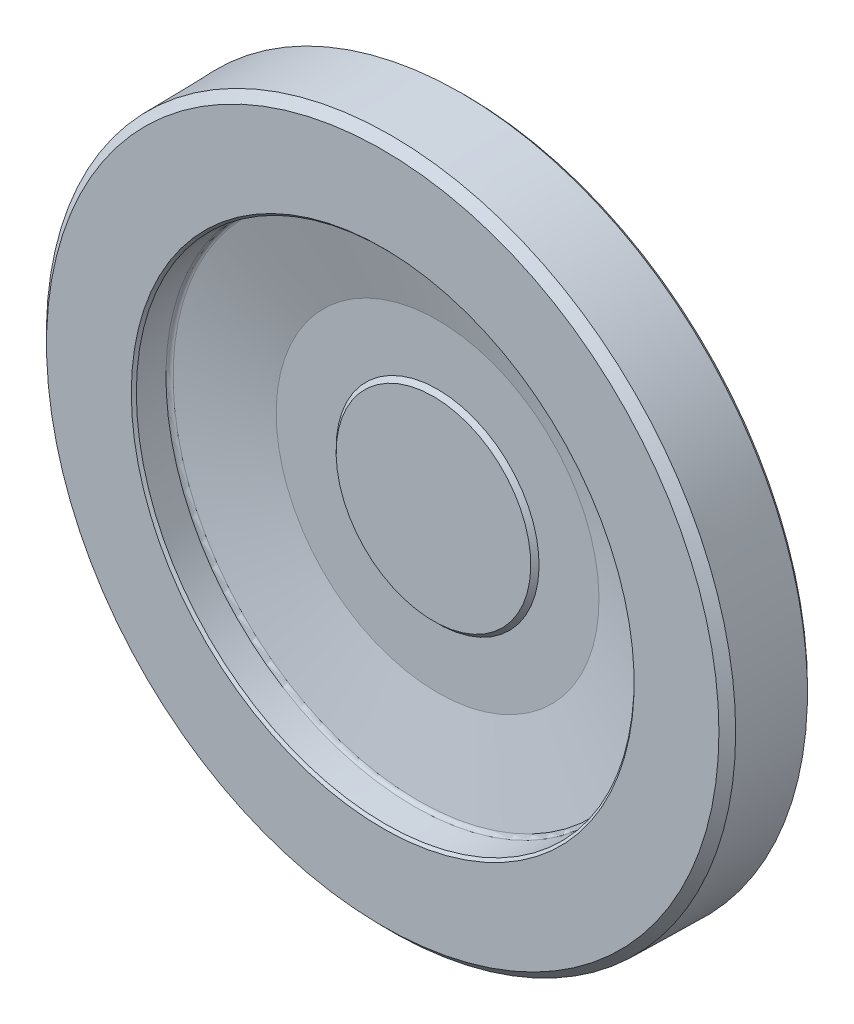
ISO-10303-21;
HEADER;
FILE_DESCRIPTION(('STEP AP214'),'2;1');
FILE_NAME('part.step','',(''),(''),'','','');
FILE_SCHEMA(('AUTOMOTIVE_DESIGN { 1 0 10303 214 1 1 1 1 }'));
ENDSEC;
DATA;
#1=APPLICATION_CONTEXT('core data for automotive mechanical design processes');
#2=APPLICATION_PROTOCOL_DEFINITION('international standard','automotive_design',2000,#1);
#3=PRODUCT_CONTEXT('',#1,'mechanical');
#4=PRODUCT('Part','Part','',(#3));
#5=PRODUCT_RELATED_PRODUCT_CATEGORY('part','',(#4));
#6=PRODUCT_DEFINITION_FORMATION('','',#4);
#7=PRODUCT_DEFINITION_CONTEXT('part definition',#1,'design');
#8=PRODUCT_DEFINITION('design','',#6,#7);
#9=PRODUCT_DEFINITION_SHAPE('','',#8);
#10=(LENGTH_UNIT() NAMED_UNIT(*) SI_UNIT(.MILLI.,.METRE.));
#11=(NAMED_UNIT(*) PLANE_ANGLE_UNIT() SI_UNIT($,.RADIAN.));
#12=(NAMED_UNIT(*) SI_UNIT($,.STERADIAN.) SOLID_ANGLE_UNIT());
#13=UNCERTAINTY_MEASURE_WITH_UNIT(LENGTH_MEASURE(1.E-05),#10,'distance_accuracy_value','');
#14=(GEOMETRIC_REPRESENTATION_CONTEXT(3) GLOBAL_UNCERTAINTY_ASSIGNED_CONTEXT((#13)) GLOBAL_UNIT_ASSIGNED_CONTEXT((#10,
#11,#12)) REPRESENTATION_CONTEXT('',''));
#15=CARTESIAN_POINT('',(0.,0.,0.));
#16=DIRECTION('',(0.,0.,1.));
#17=DIRECTION('',(1.,0.,0.));
#18=AXIS2_PLACEMENT_3D('',#15,#16,#17);
#19=CARTESIAN_POINT('',(0.,0.,38.));
#20=DIRECTION('',(0.,0.,-1.));
#21=DIRECTION('',(0.,1.,0.));
#22=AXIS2_PLACEMENT_3D('',#19,#20,#21);
#23=PLANE('',#22);
#24=CARTESIAN_POINT('',(0.,0.,38.));
#25=DIRECTION('',(0.,0.,-1.));
#26=DIRECTION('',(0.,1.,0.));
#27=AXIS2_PLACEMENT_3D('',#24,#25,#26);
#28=CIRCLE('',#27,21.1);
#29=CARTESIAN_POINT('',(0.,21.1,38.));
#30=VERTEX_POINT('',#29);
#31=EDGE_CURVE('E15',#30,#30,#28,.T.);
#32=ORIENTED_EDGE('',*,*,#31,.F.);
#33=EDGE_LOOP('',(#32));
#34=FACE_BOUND('',#33,.T.);
#35=ADVANCED_FACE('F12',(#34),#23,.F.);
#36=CARTESIAN_POINT('',(0.,0.,37.1));
#37=DIRECTION('',(0.,0.,-1.));
#38=DIRECTION('',(0.,1.,0.));
#39=AXIS2_PLACEMENT_3D('',#36,#37,#38);
#40=CONICAL_SURFACE('',#39,22.,0.785398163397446);
#41=ORIENTED_EDGE('',*,*,#31,.T.);
#42=EDGE_LOOP('',(#41));
#43=FACE_BOUND('',#42,.T.);
#44=CARTESIAN_POINT('',(0.,0.,37.1));
#45=DIRECTION('',(0.,0.,-1.));
#46=DIRECTION('',(0.,1.,0.));
#47=AXIS2_PLACEMENT_3D('',#44,#45,#46);
#48=CIRCLE('',#47,22.);
#49=CARTESIAN_POINT('',(0.,22.,37.1));
#50=VERTEX_POINT('',#49);
#51=EDGE_CURVE('E54',#50,#50,#48,.F.);
#52=ORIENTED_EDGE('',*,*,#51,.T.);
#53=EDGE_LOOP('',(#52));
#54=FACE_BOUND('',#53,.T.);
#55=ADVANCED_FACE('F61',(#43,#54),#40,.T.);
#56=CARTESIAN_POINT('',(15.25,0.,0.));
#57=DIRECTION('',(0.,0.,1.));
#58=DIRECTION('',(0.,-1.,0.));
#59=AXIS2_PLACEMENT_3D('',#56,#57,#58);
#60=PLANE('',#59);
#61=CARTESIAN_POINT('',(0.,0.,0.));
#62=DIRECTION('',(0.,0.,1.));
#63=DIRECTION('',(-1.,0.,0.));
#64=AXIS2_PLACEMENT_3D('',#61,#62,#63);
#65=CIRCLE('',#64,15.25);
#66=CARTESIAN_POINT('',(-15.25,0.,0.));
#67=VERTEX_POINT('',#66);
#68=EDGE_CURVE('E52',#67,#67,#65,.T.);
#69=ORIENTED_EDGE('',*,*,#68,.F.);
#70=EDGE_LOOP('',(#69));
#71=FACE_BOUND('',#70,.T.);
#72=ADVANCED_FACE('F68',(#71),#60,.F.);
#73=CARTESIAN_POINT('',(22.,0.,37.1));
#74=DIRECTION('',(0.,0.,-1.));
#75=DIRECTION('',(0.,1.,0.));
#76=AXIS2_PLACEMENT_3D('',#73,#74,#75);
#77=PLANE('',#76);
#78=ORIENTED_EDGE('',*,*,#51,.F.);
#79=EDGE_LOOP('',(#78));
#80=FACE_BOUND('',#79,.T.);
#81=CARTESIAN_POINT('',(0.,0.,37.1));
#82=DIRECTION('',(0.,0.,1.));
#83=DIRECTION('',(0.,-1.,0.));
#84=AXIS2_PLACEMENT_3D('',#81,#82,#83);
#85=CIRCLE('',#84,35.);
#86=CARTESIAN_POINT('',(0.,-35.,37.1));
#87=VERTEX_POINT('',#86);
#88=EDGE_CURVE('E48',#87,#87,#85,.T.);
#89=ORIENTED_EDGE('',*,*,#88,.T.);
#90=EDGE_LOOP('',(#89));
#91=FACE_BOUND('',#90,.T.);
#92=ADVANCED_FACE('F159',(#80,#91),#77,.F.);
#93=CARTESIAN_POINT('',(0.,0.,0.75));
#94=DIRECTION('',(0.,0.,1.));
#95=DIRECTION('',(-1.,0.,0.));
#96=AXIS2_PLACEMENT_3D('',#93,#94,#95);
#97=CONICAL_SURFACE('',#96,16.,0.785398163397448);
#98=CARTESIAN_POINT('',(0.,0.,0.75));
#99=DIRECTION('',(0.,0.,1.));
#100=DIRECTION('',(0.,-1.,0.));
#101=AXIS2_PLACEMENT_3D('',#98,#99,#100);
#102=CIRCLE('',#101,16.);
#103=CARTESIAN_POINT('',(0.,-16.,0.75));
#104=VERTEX_POINT('',#103);
#105=EDGE_CURVE('E51',#104,#104,#102,.T.);
#106=ORIENTED_EDGE('',*,*,#105,.F.);
#107=EDGE_LOOP('',(#106));
#108=FACE_BOUND('',#107,.T.);
#109=ORIENTED_EDGE('',*,*,#68,.T.);
#110=EDGE_LOOP('',(#109));
#111=FACE_BOUND('',#110,.T.);
#112=ADVANCED_FACE('F155',(#108,#111),#97,.T.);
#113=CARTESIAN_POINT('',(0.,0.,41.2928015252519));
#114=DIRECTION('',(0.,0.,1.));
#115=DIRECTION('',(0.,-1.,0.));
#116=AXIS2_PLACEMENT_3D('',#113,#114,#115);
#117=CONICAL_SURFACE('',#116,53.1610186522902,1.34390352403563);
#118=ORIENTED_EDGE('',*,*,#88,.F.);
#119=EDGE_LOOP('',(#118));
#120=FACE_BOUND('',#119,.T.);
#121=CARTESIAN_POINT('',(0.,0.,41.2928015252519));
#122=DIRECTION('',(0.,0.,-1.));
#123=DIRECTION('',(0.,1.,0.));
#124=AXIS2_PLACEMENT_3D('',#121,#122,#123);
#125=CIRCLE('',#124,53.1610186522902);
#126=CARTESIAN_POINT('',(0.,53.1610186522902,41.2928015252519));
#127=VERTEX_POINT('',#126);
#128=EDGE_CURVE('E47',#127,#127,#125,.F.);
#129=ORIENTED_EDGE('',*,*,#128,.T.);
#130=EDGE_LOOP('',(#129));
#131=FACE_BOUND('',#130,.T.);
#132=ADVANCED_FACE('F158',(#120,#131),#117,.F.);
#133=CARTESIAN_POINT('',(0.,0.,0.));
#134=DIRECTION('',(0.,0.,1.));
#135=DIRECTION('',(0.,-1.,0.));
#136=AXIS2_PLACEMENT_3D('',#133,#134,#135);
#137=CYLINDRICAL_SURFACE('',#136,16.);
#138=CARTESIAN_POINT('',(0.,0.,15.));
#139=DIRECTION('',(0.,0.,1.));
#140=DIRECTION('',(0.,-1.,0.));
#141=AXIS2_PLACEMENT_3D('',#138,#139,#140);
#142=CIRCLE('',#141,16.);
#143=CARTESIAN_POINT('',(0.,-16.,15.));
#144=VERTEX_POINT('',#143);
#145=EDGE_CURVE('E44',#144,#144,#142,.F.);
#146=ORIENTED_EDGE('',*,*,#145,.T.);
#147=EDGE_LOOP('',(#146));
#148=FACE_BOUND('',#147,.T.);
#149=ORIENTED_EDGE('',*,*,#105,.T.);
#150=EDGE_LOOP('',(#149));
#151=FACE_BOUND('',#150,.T.);
#152=ADVANCED_FACE('F140',(#148,#151),#137,.T.);
#153=CARTESIAN_POINT('',(0.,0.,42.1697345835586));
#154=DIRECTION('',(0.,0.,-1.));
#155=DIRECTION('',(0.,1.,0.));
#156=AXIS2_PLACEMENT_3D('',#153,#154,#155);
#157=TOROIDAL_SURFACE('',#156,52.9585627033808,0.9);
#158=ORIENTED_EDGE('',*,*,#128,.F.);
#159=EDGE_LOOP('',(#158));
#160=FACE_BOUND('',#159,.T.);
#161=CARTESIAN_POINT('',(0.,0.,42.154027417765));
#162=DIRECTION('',(0.,0.,1.));
#163=DIRECTION('',(0.,-1.,0.));
#164=AXIS2_PLACEMENT_3D('',#161,#162,#163);
#165=CIRCLE('',#164,53.8584256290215);
#166=CARTESIAN_POINT('',(0.,-53.8584256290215,42.1540274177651));
#167=VERTEX_POINT('',#166);
#168=EDGE_CURVE('E43',#167,#167,#165,.T.);
#169=ORIENTED_EDGE('',*,*,#168,.T.);
#170=EDGE_LOOP('',(#169));
#171=FACE_BOUND('',#170,.T.);
#172=ADVANCED_FACE('F135',(#160,#171),#157,.F.);
#173=CARTESIAN_POINT('',(24.,0.,15.));
#174=DIRECTION('',(0.,0.,1.));
#175=DIRECTION('',(0.,-1.,0.));
#176=AXIS2_PLACEMENT_3D('',#173,#174,#175);
#177=PLANE('',#176);
#178=CARTESIAN_POINT('',(0.,0.,15.));
#179=DIRECTION('',(0.,0.,1.));
#180=DIRECTION('',(0.,-1.,0.));
#181=AXIS2_PLACEMENT_3D('',#178,#179,#180);
#182=CIRCLE('',#181,24.);
#183=CARTESIAN_POINT('',(0.,-24.,15.));
#184=VERTEX_POINT('',#183);
#185=EDGE_CURVE('E39',#184,#184,#182,.T.);
#186=ORIENTED_EDGE('',*,*,#185,.F.);
#187=EDGE_LOOP('',(#186));
#188=FACE_BOUND('',#187,.T.);
#189=ORIENTED_EDGE('',*,*,#145,.F.);
#190=EDGE_LOOP('',(#189));
#191=FACE_BOUND('',#190,.T.);
#192=ADVANCED_FACE('F131',(#188,#191),#177,.F.);
#193=CARTESIAN_POINT('',(0.,0.,48.4600822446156));
#194=DIRECTION('',(0.,0.,1.));
#195=DIRECTION('',(0.,-1.,0.));
#196=AXIS2_PLACEMENT_3D('',#193,#194,#195);
#197=CONICAL_SURFACE('',#196,53.9684982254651,0.0174532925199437);
#198=ORIENTED_EDGE('',*,*,#168,.F.);
#199=EDGE_LOOP('',(#198));
#200=FACE_BOUND('',#199,.T.);
#201=CARTESIAN_POINT('',(0.,0.,48.4600822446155));
#202=DIRECTION('',(0.,0.,1.));
#203=DIRECTION('',(0.,-1.,0.));
#204=AXIS2_PLACEMENT_3D('',#201,#202,#203);
#205=CIRCLE('',#204,53.9684982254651);
#206=CARTESIAN_POINT('',(0.,-53.9684982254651,48.4600822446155));
#207=VERTEX_POINT('',#206);
#208=EDGE_CURVE('E42',#207,#207,#205,.T.);
#209=ORIENTED_EDGE('',*,*,#208,.T.);
#210=EDGE_LOOP('',(#209));
#211=FACE_BOUND('',#210,.T.);
#212=ADVANCED_FACE('F127',(#200,#211),#197,.F.);
#213=CARTESIAN_POINT('',(0.,0.,0.));
#214=DIRECTION('',(0.,0.,1.));
#215=DIRECTION('',(0.,-1.,0.));
#216=AXIS2_PLACEMENT_3D('',#213,#214,#215);
#217=CYLINDRICAL_SURFACE('',#216,24.);
#218=CARTESIAN_POINT('',(0.,0.,22.3765148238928));
#219=DIRECTION('',(0.,0.,-1.));
#220=DIRECTION('',(0.,1.,0.));
#221=AXIS2_PLACEMENT_3D('',#218,#219,#220);
#222=CIRCLE('',#221,24.);
#223=CARTESIAN_POINT('',(0.,24.,22.3765148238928));
#224=VERTEX_POINT('',#223);
#225=EDGE_CURVE('E38',#224,#224,#222,.T.);
#226=ORIENTED_EDGE('',*,*,#225,.T.);
#227=EDGE_LOOP('',(#226));
#228=FACE_BOUND('',#227,.T.);
#229=ORIENTED_EDGE('',*,*,#185,.T.);
#230=EDGE_LOOP('',(#229));
#231=FACE_BOUND('',#230,.T.);
#232=ADVANCED_FACE('F123',(#228,#231),#217,.T.);
#233=CARTESIAN_POINT('',(0.,0.,49.));
#234=DIRECTION('',(0.,0.,1.));
#235=DIRECTION('',(-1.,0.,0.));
#236=AXIS2_PLACEMENT_3D('',#233,#234,#235);
#237=CONICAL_SURFACE('',#236,54.5179225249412,0.794124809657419);
#238=ORIENTED_EDGE('',*,*,#208,.F.);
#239=EDGE_LOOP('',(#238));
#240=FACE_BOUND('',#239,.T.);
#241=CARTESIAN_POINT('',(0.,0.,49.));
#242=DIRECTION('',(0.,0.,1.));
#243=DIRECTION('',(-1.,0.,0.));
#244=AXIS2_PLACEMENT_3D('',#241,#242,#243);
#245=CIRCLE('',#244,54.5179225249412);
#246=CARTESIAN_POINT('',(-54.5179225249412,0.,49.));
#247=VERTEX_POINT('',#246);
#248=EDGE_CURVE('E35',#247,#247,#245,.T.);
#249=ORIENTED_EDGE('',*,*,#248,.T.);
#250=EDGE_LOOP('',(#249));
#251=FACE_BOUND('',#250,.T.);
#252=ADVANCED_FACE('F119',(#240,#251),#237,.F.);
#253=CARTESIAN_POINT('',(0.,0.,22.3765148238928));
#254=DIRECTION('',(0.,0.,-1.));
#255=DIRECTION('',(0.,1.,0.));
#256=AXIS2_PLACEMENT_3D('',#253,#254,#255);
#257=TOROIDAL_SURFACE('',#256,25.8,1.8);
#258=CARTESIAN_POINT('',(0.,0.,24.0679615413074));
#259=DIRECTION('',(0.,0.,1.));
#260=DIRECTION('',(0.,-1.,0.));
#261=AXIS2_PLACEMENT_3D('',#258,#259,#260);
#262=CIRCLE('',#261,25.1843637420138);
#263=CARTESIAN_POINT('',(0.,-25.1843637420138,24.0679615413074));
#264=VERTEX_POINT('',#263);
#265=EDGE_CURVE('E34',#264,#264,#262,.T.);
#266=ORIENTED_EDGE('',*,*,#265,.F.);
#267=EDGE_LOOP('',(#266));
#268=FACE_BOUND('',#267,.T.);
#269=ORIENTED_EDGE('',*,*,#225,.F.);
#270=EDGE_LOOP('',(#269));
#271=FACE_BOUND('',#270,.T.);
#272=ADVANCED_FACE('F114',(#268,#271),#257,.F.);
#273=CARTESIAN_POINT('',(54.5179225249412,0.,49.));
#274=DIRECTION('',(0.,0.,-1.));
#275=DIRECTION('',(0.,1.,0.));
#276=AXIS2_PLACEMENT_3D('',#273,#274,#275);
#277=PLANE('',#276);
#278=ORIENTED_EDGE('',*,*,#248,.F.);
#279=EDGE_LOOP('',(#278));
#280=FACE_BOUND('',#279,.T.);
#281=CARTESIAN_POINT('',(0.,0.,49.));
#282=DIRECTION('',(0.,0.,-1.));
#283=DIRECTION('',(1.,0.,0.));
#284=AXIS2_PLACEMENT_3D('',#281,#282,#283);
#285=CIRCLE('',#284,72.9015183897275);
#286=CARTESIAN_POINT('',(72.9015183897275,0.,49.));
#287=VERTEX_POINT('',#286);
#288=EDGE_CURVE('E30',#287,#287,#285,.T.);
#289=ORIENTED_EDGE('',*,*,#288,.F.);
#290=EDGE_LOOP('',(#289));
#291=FACE_BOUND('',#290,.T.);
#292=ADVANCED_FACE('F118',(#280,#291),#277,.F.);
#293=CARTESIAN_POINT('',(0.,0.,34.0603901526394));
#294=DIRECTION('',(0.,0.,1.));
#295=DIRECTION('',(0.,-1.,0.));
#296=AXIS2_PLACEMENT_3D('',#293,#294,#295);
#297=CONICAL_SURFACE('',#296,52.6383357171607,1.22173047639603);
#298=CARTESIAN_POINT('',(0.,0.,34.0603901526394));
#299=DIRECTION('',(0.,0.,-1.));
#300=DIRECTION('',(0.,1.,0.));
#301=AXIS2_PLACEMENT_3D('',#298,#299,#300);
#302=CIRCLE('',#301,52.6383357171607);
#303=CARTESIAN_POINT('',(0.,52.6383357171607,34.0603901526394));
#304=VERTEX_POINT('',#303);
#305=EDGE_CURVE('E33',#304,#304,#302,.T.);
#306=ORIENTED_EDGE('',*,*,#305,.T.);
#307=EDGE_LOOP('',(#306));
#308=FACE_BOUND('',#307,.T.);
#309=ORIENTED_EDGE('',*,*,#265,.T.);
#310=EDGE_LOOP('',(#309));
#311=FACE_BOUND('',#310,.T.);
#312=ADVANCED_FACE('F201',(#308,#311),#297,.T.);
#313=CARTESIAN_POINT('',(0.,0.,47.2002741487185));
#314=DIRECTION('',(0.,0.,-1.));
#315=DIRECTION('',(1.,0.,0.));
#316=AXIS2_PLACEMENT_3D('',#313,#314,#315);
#317=CONICAL_SURFACE('',#316,74.7329327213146,0.794124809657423);
#318=ORIENTED_EDGE('',*,*,#288,.T.);
#319=EDGE_LOOP('',(#318));
#320=FACE_BOUND('',#319,.T.);
#321=CARTESIAN_POINT('',(0.,0.,47.2002741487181));
#322=DIRECTION('',(0.,0.,-1.));
#323=DIRECTION('',(0.,1.,0.));
#324=AXIS2_PLACEMENT_3D('',#321,#322,#323);
#325=CIRCLE('',#324,74.7329327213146);
#326=CARTESIAN_POINT('',(0.,74.7329327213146,47.2002741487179));
#327=VERTEX_POINT('',#326);
#328=EDGE_CURVE('E103',#327,#327,#325,.T.);
#329=ORIENTED_EDGE('',*,*,#328,.F.);
#330=EDGE_LOOP('',(#329));
#331=FACE_BOUND('',#330,.T.);
#332=ADVANCED_FACE('F93',(#320,#331),#317,.T.);
#333=CARTESIAN_POINT('',(0.,0.,33.2146667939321));
#334=DIRECTION('',(0.,0.,-1.));
#335=DIRECTION('',(0.,1.,0.));
#336=AXIS2_PLACEMENT_3D('',#333,#334,#335);
#337=TOROIDAL_SURFACE('',#336,52.9461538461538,0.900000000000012);
#338=CARTESIAN_POINT('',(0.,0.,33.2146667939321));
#339=DIRECTION('',(0.,0.,1.));
#340=DIRECTION('',(0.,-1.,0.));
#341=AXIS2_PLACEMENT_3D('',#338,#339,#340);
#342=CIRCLE('',#341,53.8461538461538);
#343=CARTESIAN_POINT('',(0.,-53.8461538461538,33.2146667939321));
#344=VERTEX_POINT('',#343);
#345=EDGE_CURVE('E208',#344,#344,#342,.F.);
#346=ORIENTED_EDGE('',*,*,#345,.T.);
#347=EDGE_LOOP('',(#346));
#348=FACE_BOUND('',#347,.T.);
#349=ORIENTED_EDGE('',*,*,#305,.F.);
#350=EDGE_LOOP('',(#349));
#351=FACE_BOUND('',#350,.T.);
#352=ADVANCED_FACE('F88',(#348,#351),#337,.F.);
#353=CARTESIAN_POINT('',(0.,0.,31.8998629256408));
#354=DIRECTION('',(0.,0.,-1.));
#355=DIRECTION('',(0.,1.,0.));
#356=AXIS2_PLACEMENT_3D('',#353,#354,#355);
#357=CONICAL_SURFACE('',#356,75.0000023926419,0.0174532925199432);
#358=ORIENTED_EDGE('',*,*,#328,.T.);
#359=EDGE_LOOP('',(#358));
#360=FACE_BOUND('',#359,.T.);
#361=CARTESIAN_POINT('',(0.,0.,31.8998629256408));
#362=DIRECTION('',(0.,0.,1.));
#363=DIRECTION('',(0.,-1.,0.));
#364=AXIS2_PLACEMENT_3D('',#361,#362,#363);
#365=CIRCLE('',#364,75.0000023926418);
#366=CARTESIAN_POINT('',(0.,-75.0000023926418,31.8998629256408));
#367=VERTEX_POINT('',#366);
#368=EDGE_CURVE('E24',#367,#367,#365,.F.);
#369=ORIENTED_EDGE('',*,*,#368,.F.);
#370=EDGE_LOOP('',(#369));
#371=FACE_BOUND('',#370,.T.);
#372=ADVANCED_FACE('F84',(#360,#371),#357,.T.);
#373=CARTESIAN_POINT('',(0.,0.,0.));
#374=DIRECTION('',(0.,0.,1.));
#375=DIRECTION('',(0.,-1.,0.));
#376=AXIS2_PLACEMENT_3D('',#373,#374,#375);
#377=CYLINDRICAL_SURFACE('',#376,53.8461538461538);
#378=CARTESIAN_POINT('',(0.,0.,31.));
#379=DIRECTION('',(0.,0.,1.));
#380=DIRECTION('',(0.,-1.,0.));
#381=AXIS2_PLACEMENT_3D('',#378,#379,#380);
#382=CIRCLE('',#381,53.8461538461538);
#383=CARTESIAN_POINT('',(0.,-53.8461538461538,31.));
#384=VERTEX_POINT('',#383);
#385=EDGE_CURVE('E19',#384,#384,#382,.F.);
#386=ORIENTED_EDGE('',*,*,#385,.T.);
#387=EDGE_LOOP('',(#386));
#388=FACE_BOUND('',#387,.T.);
#389=ORIENTED_EDGE('',*,*,#345,.F.);
#390=EDGE_LOOP('',(#389));
#391=FACE_BOUND('',#390,.T.);
#392=ADVANCED_FACE('F77',(#388,#391),#377,.F.);
#393=CARTESIAN_POINT('',(0.,0.,31.8998629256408));
#394=DIRECTION('',(0.,0.,1.));
#395=DIRECTION('',(0.,-1.,0.));
#396=AXIS2_PLACEMENT_3D('',#393,#394,#395);
#397=CONICAL_SURFACE('',#396,75.0000023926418,0.776671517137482);
#398=ORIENTED_EDGE('',*,*,#368,.T.);
#399=EDGE_LOOP('',(#398));
#400=FACE_BOUND('',#399,.T.);
#401=CARTESIAN_POINT('',(0.,0.,31.));
#402=DIRECTION('',(0.,0.,1.));
#403=DIRECTION('',(0.,-1.,0.));
#404=AXIS2_PLACEMENT_3D('',#401,#402,#403);
#405=CIRCLE('',#404,74.1157095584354);
#406=CARTESIAN_POINT('',(0.,-74.1157095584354,31.));
#407=VERTEX_POINT('',#406);
#408=EDGE_CURVE('E8',#407,#407,#405,.T.);
#409=ORIENTED_EDGE('',*,*,#408,.T.);
#410=EDGE_LOOP('',(#409));
#411=FACE_BOUND('',#410,.T.);
#412=ADVANCED_FACE('F71',(#400,#411),#397,.T.);
#413=CARTESIAN_POINT('',(74.1157095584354,0.,31.));
#414=DIRECTION('',(0.,0.,1.));
#415=DIRECTION('',(0.,-1.,0.));
#416=AXIS2_PLACEMENT_3D('',#413,#414,#415);
#417=PLANE('',#416);
#418=ORIENTED_EDGE('',*,*,#408,.F.);
#419=EDGE_LOOP('',(#418));
#420=FACE_BOUND('',#419,.T.);
#421=ORIENTED_EDGE('',*,*,#385,.F.);
#422=EDGE_LOOP('',(#421));
#423=FACE_BOUND('',#422,.T.);
#424=ADVANCED_FACE('F69',(#420,#423),#417,.F.);
#425=CLOSED_SHELL('',(#35,#55,#72,#92,#112,#132,#152,#172,#192,#212,#232,#252,#272,#292,#312,
#332,#352,#372,#392,#412,#424));
#426=MANIFOLD_SOLID_BREP('B1',#425);
#427=ADVANCED_BREP_SHAPE_REPRESENTATION('',(#18,#426),#14);
#428=SHAPE_DEFINITION_REPRESENTATION(#9,#427);
ENDSEC;
END-ISO-10303-21;
